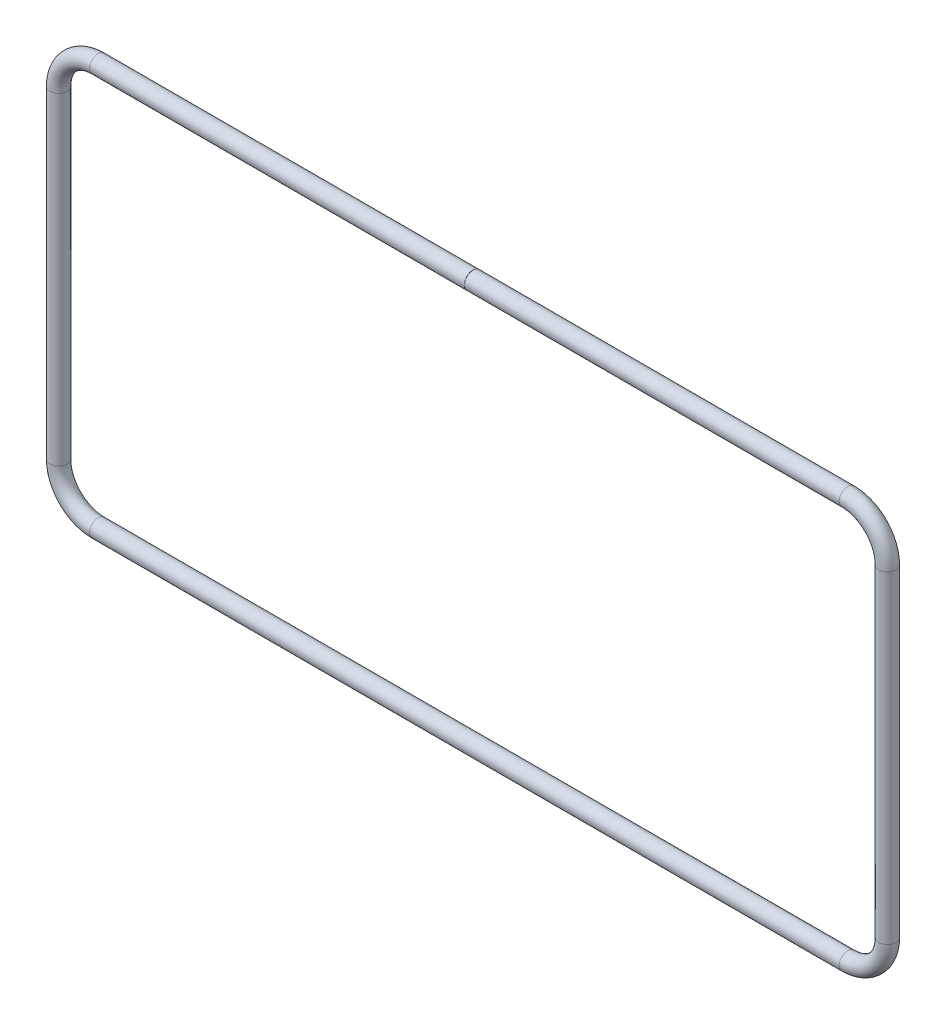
ISO-10303-21;
HEADER;
FILE_DESCRIPTION(('STEP AP214'),'2;1');
FILE_NAME('part.step','',(''),(''),'','','');
FILE_SCHEMA(('AUTOMOTIVE_DESIGN { 1 0 10303 214 1 1 1 1 }'));
ENDSEC;
DATA;
#1=APPLICATION_CONTEXT('core data for automotive mechanical design processes');
#2=APPLICATION_PROTOCOL_DEFINITION('international standard','automotive_design',2000,#1);
#3=PRODUCT_CONTEXT('',#1,'mechanical');
#4=PRODUCT('Part','Part','',(#3));
#5=PRODUCT_RELATED_PRODUCT_CATEGORY('part','',(#4));
#6=PRODUCT_DEFINITION_FORMATION('','',#4);
#7=PRODUCT_DEFINITION_CONTEXT('part definition',#1,'design');
#8=PRODUCT_DEFINITION('design','',#6,#7);
#9=PRODUCT_DEFINITION_SHAPE('','',#8);
#10=(LENGTH_UNIT() NAMED_UNIT(*) SI_UNIT(.MILLI.,.METRE.));
#11=(NAMED_UNIT(*) PLANE_ANGLE_UNIT() SI_UNIT($,.RADIAN.));
#12=(NAMED_UNIT(*) SI_UNIT($,.STERADIAN.) SOLID_ANGLE_UNIT());
#13=UNCERTAINTY_MEASURE_WITH_UNIT(LENGTH_MEASURE(1.E-05),#10,'distance_accuracy_value','');
#14=(GEOMETRIC_REPRESENTATION_CONTEXT(3) GLOBAL_UNCERTAINTY_ASSIGNED_CONTEXT((#13)) GLOBAL_UNIT_ASSIGNED_CONTEXT((#10,
#11,#12)) REPRESENTATION_CONTEXT('',''));
#15=CARTESIAN_POINT('',(0.,0.,0.));
#16=DIRECTION('',(0.,0.,1.));
#17=DIRECTION('',(1.,0.,0.));
#18=AXIS2_PLACEMENT_3D('',#15,#16,#17);
#19=CARTESIAN_POINT('',(76.9492999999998,41.2623000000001,0.));
#20=DIRECTION('',(-0.999999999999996,0.,0.));
#21=DIRECTION('',(0.,-1.,0.));
#22=AXIS2_PLACEMENT_3D('',#19,#20,#21);
#23=CYLINDRICAL_SURFACE('',#22,1.7653);
#24=CARTESIAN_POINT('',(76.9492999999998,41.2623000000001,0.));
#25=DIRECTION('',(0.999999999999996,0.,0.));
#26=DIRECTION('',(0.,0.,-1.));
#27=AXIS2_PLACEMENT_3D('',#24,#25,#26);
#28=CIRCLE('',#27,1.7653);
#29=CARTESIAN_POINT('',(76.9492999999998,43.0276000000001,0.));
#30=VERTEX_POINT('',#29);
#31=EDGE_CURVE('E38',#30,#30,#28,.T.);
#32=ORIENTED_EDGE('',*,*,#31,.F.);
#33=EDGE_LOOP('',(#32));
#34=FACE_BOUND('',#33,.T.);
#35=CARTESIAN_POINT('',(0.0253999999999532,41.2623,0.));
#36=DIRECTION('',(0.999999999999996,0.,0.));
#37=DIRECTION('',(0.,0.,-1.));
#38=AXIS2_PLACEMENT_3D('',#35,#36,#37);
#39=CIRCLE('',#38,1.7653);
#40=CARTESIAN_POINT('',(0.0253999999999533,41.2623,-1.7653));
#41=VERTEX_POINT('',#40);
#42=EDGE_CURVE('E10',#41,#41,#39,.T.);
#43=ORIENTED_EDGE('',*,*,#42,.T.);
#44=EDGE_LOOP('',(#43));
#45=FACE_BOUND('',#44,.T.);
#46=ADVANCED_FACE('F32',(#34,#45),#23,.T.);
#47=CARTESIAN_POINT('',(76.9492999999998,33.1343000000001,0.));
#48=DIRECTION('',(0.,0.,1.));
#49=DIRECTION('',(0.999999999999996,0.,0.));
#50=AXIS2_PLACEMENT_3D('',#47,#48,#49);
#51=TOROIDAL_SURFACE('',#50,8.128,1.7653);
#52=CARTESIAN_POINT('',(85.0772999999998,33.1343000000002,0.));
#53=DIRECTION('',(0.,-1.,0.));
#54=DIRECTION('',(0.,0.,-1.));
#55=AXIS2_PLACEMENT_3D('',#52,#53,#54);
#56=CIRCLE('',#55,1.7653);
#57=CARTESIAN_POINT('',(86.8425999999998,33.1343000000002,0.));
#58=VERTEX_POINT('',#57);
#59=EDGE_CURVE('E42',#58,#58,#56,.T.);
#60=CARTESIAN_POINT('',(76.9492999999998,33.1343000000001,0.));
#61=DIRECTION('',(0.,0.,1.));
#62=DIRECTION('',(0.999999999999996,0.,0.));
#63=AXIS2_PLACEMENT_3D('',#60,#61,#62);
#64=CIRCLE('',#63,9.8933);
#65=EDGE_CURVE('',#58,#30,#64,.T.);
#66=ORIENTED_EDGE('',*,*,#59,.F.);
#67=ORIENTED_EDGE('',*,*,#31,.T.);
#68=ORIENTED_EDGE('',*,*,#65,.T.);
#69=ORIENTED_EDGE('',*,*,#65,.F.);
#70=EDGE_LOOP('',(#66,#68,#67,#69));
#71=FACE_BOUND('',#70,.T.);
#72=ADVANCED_FACE('F88',(#71),#51,.T.);
#73=CARTESIAN_POINT('',(85.0772999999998,-33.1342999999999,0.));
#74=DIRECTION('',(0.,1.,0.));
#75=DIRECTION('',(0.,0.,1.));
#76=AXIS2_PLACEMENT_3D('',#73,#74,#75);
#77=CYLINDRICAL_SURFACE('',#76,1.7653);
#78=CARTESIAN_POINT('',(85.0772999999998,-33.1342999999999,0.));
#79=DIRECTION('',(0.,-1.,0.));
#80=DIRECTION('',(0.,0.,-1.));
#81=AXIS2_PLACEMENT_3D('',#78,#79,#80);
#82=CIRCLE('',#81,1.7653);
#83=CARTESIAN_POINT('',(86.8425999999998,-33.1342999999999,0.));
#84=VERTEX_POINT('',#83);
#85=EDGE_CURVE('E46',#84,#84,#82,.T.);
#86=ORIENTED_EDGE('',*,*,#85,.F.);
#87=EDGE_LOOP('',(#86));
#88=FACE_BOUND('',#87,.T.);
#89=ORIENTED_EDGE('',*,*,#59,.T.);
#90=EDGE_LOOP('',(#89));
#91=FACE_BOUND('',#90,.T.);
#92=ADVANCED_FACE('F93',(#88,#91),#77,.T.);
#93=CARTESIAN_POINT('',(76.9492999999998,-33.1342999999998,0.));
#94=DIRECTION('',(0.,0.,1.));
#95=DIRECTION('',(0.999999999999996,0.,0.));
#96=AXIS2_PLACEMENT_3D('',#93,#94,#95);
#97=TOROIDAL_SURFACE('',#96,8.12799999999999,1.7653);
#98=CARTESIAN_POINT('',(76.9492999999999,-41.2622999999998,0.));
#99=DIRECTION('',(-0.999999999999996,0.,0.));
#100=DIRECTION('',(0.,0.,-1.));
#101=AXIS2_PLACEMENT_3D('',#98,#99,#100);
#102=CIRCLE('',#101,1.7653);
#103=CARTESIAN_POINT('',(76.9492999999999,-43.0275999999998,0.));
#104=VERTEX_POINT('',#103);
#105=EDGE_CURVE('E51',#104,#104,#102,.T.);
#106=CARTESIAN_POINT('',(76.9492999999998,-33.1342999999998,0.));
#107=DIRECTION('',(0.,0.,1.));
#108=DIRECTION('',(0.999999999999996,0.,0.));
#109=AXIS2_PLACEMENT_3D('',#106,#107,#108);
#110=CIRCLE('',#109,9.89329999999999);
#111=EDGE_CURVE('',#104,#84,#110,.T.);
#112=ORIENTED_EDGE('',*,*,#105,.F.);
#113=ORIENTED_EDGE('',*,*,#85,.T.);
#114=ORIENTED_EDGE('',*,*,#111,.T.);
#115=ORIENTED_EDGE('',*,*,#111,.F.);
#116=EDGE_LOOP('',(#112,#114,#113,#115));
#117=FACE_BOUND('',#116,.T.);
#118=ADVANCED_FACE('F98',(#117),#97,.T.);
#119=CARTESIAN_POINT('',(-76.9492999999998,-41.2623000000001,0.));
#120=DIRECTION('',(0.999999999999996,0.,0.));
#121=DIRECTION('',(0.,1.,0.));
#122=AXIS2_PLACEMENT_3D('',#119,#120,#121);
#123=CYLINDRICAL_SURFACE('',#122,1.7653);
#124=CARTESIAN_POINT('',(-76.9492999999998,-41.2623000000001,0.));
#125=DIRECTION('',(-0.999999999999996,0.,0.));
#126=DIRECTION('',(0.,0.,-1.));
#127=AXIS2_PLACEMENT_3D('',#124,#125,#126);
#128=CIRCLE('',#127,1.7653);
#129=CARTESIAN_POINT('',(-76.9492999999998,-43.0276000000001,0.));
#130=VERTEX_POINT('',#129);
#131=EDGE_CURVE('E54',#130,#130,#128,.T.);
#132=ORIENTED_EDGE('',*,*,#131,.F.);
#133=EDGE_LOOP('',(#132));
#134=FACE_BOUND('',#133,.T.);
#135=ORIENTED_EDGE('',*,*,#105,.T.);
#136=EDGE_LOOP('',(#135));
#137=FACE_BOUND('',#136,.T.);
#138=ADVANCED_FACE('F105',(#134,#137),#123,.T.);
#139=CARTESIAN_POINT('',(-76.9492999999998,-33.1343000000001,0.));
#140=DIRECTION('',(0.,0.,1.));
#141=DIRECTION('',(0.999999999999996,0.,0.));
#142=AXIS2_PLACEMENT_3D('',#139,#140,#141);
#143=TOROIDAL_SURFACE('',#142,8.12800000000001,1.7653);
#144=CARTESIAN_POINT('',(-85.0772999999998,-33.1343000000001,0.));
#145=DIRECTION('',(0.,1.,0.));
#146=DIRECTION('',(0.,0.,-1.));
#147=AXIS2_PLACEMENT_3D('',#144,#145,#146);
#148=CIRCLE('',#147,1.7653);
#149=CARTESIAN_POINT('',(-86.8425999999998,-33.1343000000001,0.));
#150=VERTEX_POINT('',#149);
#151=EDGE_CURVE('E57',#150,#150,#148,.T.);
#152=CARTESIAN_POINT('',(-76.9492999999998,-33.1343000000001,0.));
#153=DIRECTION('',(0.,0.,1.));
#154=DIRECTION('',(0.999999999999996,0.,0.));
#155=AXIS2_PLACEMENT_3D('',#152,#153,#154);
#156=CIRCLE('',#155,9.89330000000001);
#157=EDGE_CURVE('',#150,#130,#156,.T.);
#158=ORIENTED_EDGE('',*,*,#151,.F.);
#159=ORIENTED_EDGE('',*,*,#131,.T.);
#160=ORIENTED_EDGE('',*,*,#157,.T.);
#161=ORIENTED_EDGE('',*,*,#157,.F.);
#162=EDGE_LOOP('',(#158,#160,#159,#161));
#163=FACE_BOUND('',#162,.T.);
#164=ADVANCED_FACE('F109',(#163),#143,.T.);
#165=CARTESIAN_POINT('',(-85.0772999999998,33.1342999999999,0.));
#166=DIRECTION('',(0.,-1.,0.));
#167=DIRECTION('',(0.,0.,-1.));
#168=AXIS2_PLACEMENT_3D('',#165,#166,#167);
#169=CYLINDRICAL_SURFACE('',#168,1.7653);
#170=CARTESIAN_POINT('',(-85.0772999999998,33.1342999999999,0.));
#171=DIRECTION('',(0.,1.,0.));
#172=DIRECTION('',(0.,0.,-1.));
#173=AXIS2_PLACEMENT_3D('',#170,#171,#172);
#174=CIRCLE('',#173,1.7653);
#175=CARTESIAN_POINT('',(-86.8425999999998,33.1342999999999,0.));
#176=VERTEX_POINT('',#175);
#177=EDGE_CURVE('E60',#176,#176,#174,.T.);
#178=ORIENTED_EDGE('',*,*,#177,.F.);
#179=EDGE_LOOP('',(#178));
#180=FACE_BOUND('',#179,.T.);
#181=ORIENTED_EDGE('',*,*,#151,.T.);
#182=EDGE_LOOP('',(#181));
#183=FACE_BOUND('',#182,.T.);
#184=ADVANCED_FACE('F84',(#180,#183),#169,.T.);
#185=CARTESIAN_POINT('',(-76.9492999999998,33.1342999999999,0.));
#186=DIRECTION('',(0.,0.,1.));
#187=DIRECTION('',(0.999999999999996,0.,0.));
#188=AXIS2_PLACEMENT_3D('',#185,#186,#187);
#189=TOROIDAL_SURFACE('',#188,8.128,1.7653);
#190=CARTESIAN_POINT('',(-76.9492999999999,41.2622999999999,0.));
#191=DIRECTION('',(0.999999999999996,0.,0.));
#192=DIRECTION('',(0.,0.,-1.));
#193=AXIS2_PLACEMENT_3D('',#190,#191,#192);
#194=CIRCLE('',#193,1.7653);
#195=CARTESIAN_POINT('',(-76.9492999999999,43.0275999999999,0.));
#196=VERTEX_POINT('',#195);
#197=EDGE_CURVE('E63',#196,#196,#194,.T.);
#198=CARTESIAN_POINT('',(-76.9492999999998,33.1342999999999,0.));
#199=DIRECTION('',(0.,0.,1.));
#200=DIRECTION('',(0.999999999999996,0.,0.));
#201=AXIS2_PLACEMENT_3D('',#198,#199,#200);
#202=CIRCLE('',#201,9.8933);
#203=EDGE_CURVE('',#196,#176,#202,.T.);
#204=ORIENTED_EDGE('',*,*,#197,.F.);
#205=ORIENTED_EDGE('',*,*,#177,.T.);
#206=ORIENTED_EDGE('',*,*,#203,.T.);
#207=ORIENTED_EDGE('',*,*,#203,.F.);
#208=EDGE_LOOP('',(#204,#206,#205,#207));
#209=FACE_BOUND('',#208,.T.);
#210=ADVANCED_FACE('F75',(#209),#189,.T.);
#211=CARTESIAN_POINT('',(-76.9492999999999,41.2622999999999,0.));
#212=DIRECTION('',(0.999999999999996,0.,0.));
#213=DIRECTION('',(0.,1.,0.));
#214=AXIS2_PLACEMENT_3D('',#211,#212,#213);
#215=CYLINDRICAL_SURFACE('',#214,1.7653);
#216=CARTESIAN_POINT('',(0.,41.2623,0.));
#217=DIRECTION('',(0.999999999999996,0.,0.));
#218=DIRECTION('',(0.,0.,-1.));
#219=AXIS2_PLACEMENT_3D('',#216,#217,#218);
#220=CIRCLE('',#219,1.7653);
#221=CARTESIAN_POINT('',(0.,43.0276,0.));
#222=VERTEX_POINT('',#221);
#223=EDGE_CURVE('E66',#222,#222,#220,.T.);
#224=CARTESIAN_POINT('',(-76.9492999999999,43.0275999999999,0.));
#225=CARTESIAN_POINT('',(-76.1477447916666,43.0275999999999,0.));
#226=CARTESIAN_POINT('',(-75.3461895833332,43.0275999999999,0.));
#227=CARTESIAN_POINT('',(-73.7430791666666,43.0275999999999,0.));
#228=CARTESIAN_POINT('',(-72.9415239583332,43.0275999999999,0.));
#229=CARTESIAN_POINT('',(-71.3384135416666,43.0275999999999,0.));
#230=CARTESIAN_POINT('',(-70.5368583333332,43.0275999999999,0.));
#231=CARTESIAN_POINT('',(-68.9337479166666,43.0275999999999,0.));
#232=CARTESIAN_POINT('',(-68.1321927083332,43.0275999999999,0.));
#233=CARTESIAN_POINT('',(-66.5290822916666,43.0275999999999,0.));
#234=CARTESIAN_POINT('',(-65.7275270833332,43.0275999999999,0.));
#235=CARTESIAN_POINT('',(-64.1244166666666,43.0275999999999,0.));
#236=CARTESIAN_POINT('',(-63.3228614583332,43.0275999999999,0.));
#237=CARTESIAN_POINT('',(-61.7197510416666,43.0275999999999,0.));
#238=CARTESIAN_POINT('',(-60.9181958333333,43.0275999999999,0.));
#239=CARTESIAN_POINT('',(-59.3150854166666,43.0275999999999,0.));
#240=CARTESIAN_POINT('',(-58.5135302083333,43.0275999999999,0.));
#241=CARTESIAN_POINT('',(-56.9104197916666,43.0275999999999,0.));
#242=CARTESIAN_POINT('',(-56.1088645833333,43.0275999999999,0.));
#243=CARTESIAN_POINT('',(-54.5057541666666,43.0275999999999,0.));
#244=CARTESIAN_POINT('',(-53.7041989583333,43.0275999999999,0.));
#245=CARTESIAN_POINT('',(-52.1010885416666,43.0275999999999,0.));
#246=CARTESIAN_POINT('',(-51.2995333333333,43.0275999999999,0.));
#247=CARTESIAN_POINT('',(-49.6964229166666,43.0275999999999,0.));
#248=CARTESIAN_POINT('',(-48.8948677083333,43.0275999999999,0.));
#249=CARTESIAN_POINT('',(-47.2917572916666,43.0275999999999,0.));
#250=CARTESIAN_POINT('',(-46.4902020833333,43.0275999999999,0.));
#251=CARTESIAN_POINT('',(-44.8870916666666,43.0275999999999,0.));
#252=CARTESIAN_POINT('',(-44.0855364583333,43.0275999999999,0.));
#253=CARTESIAN_POINT('',(-42.4824260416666,43.0275999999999,0.));
#254=CARTESIAN_POINT('',(-41.6808708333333,43.0275999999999,0.));
#255=CARTESIAN_POINT('',(-40.0777604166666,43.0275999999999,0.));
#256=CARTESIAN_POINT('',(-39.2762052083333,43.0275999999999,0.));
#257=CARTESIAN_POINT('',(-37.6730947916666,43.0275999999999,0.));
#258=CARTESIAN_POINT('',(-36.8715395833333,43.0275999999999,0.));
#259=CARTESIAN_POINT('',(-35.2684291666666,43.0275999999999,0.));
#260=CARTESIAN_POINT('',(-34.4668739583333,43.0275999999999,0.));
#261=CARTESIAN_POINT('',(-32.8637635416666,43.0275999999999,0.));
#262=CARTESIAN_POINT('',(-32.0622083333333,43.0275999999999,0.));
#263=CARTESIAN_POINT('',(-30.4590979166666,43.0275999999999,0.));
#264=CARTESIAN_POINT('',(-29.6575427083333,43.0275999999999,0.));
#265=CARTESIAN_POINT('',(-28.0544322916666,43.0275999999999,0.));
#266=CARTESIAN_POINT('',(-27.2528770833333,43.0276,0.));
#267=CARTESIAN_POINT('',(-25.6497666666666,43.0276,0.));
#268=CARTESIAN_POINT('',(-24.8482114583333,43.0276,0.));
#269=CARTESIAN_POINT('',(-23.2451010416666,43.0276,0.));
#270=CARTESIAN_POINT('',(-22.4435458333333,43.0276,0.));
#271=CARTESIAN_POINT('',(-20.8404354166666,43.0276,0.));
#272=CARTESIAN_POINT('',(-20.0388802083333,43.0276,0.));
#273=CARTESIAN_POINT('',(-18.4357697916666,43.0276,0.));
#274=CARTESIAN_POINT('',(-17.6342145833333,43.0276,0.));
#275=CARTESIAN_POINT('',(-16.0311041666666,43.0276,0.));
#276=CARTESIAN_POINT('',(-15.2295489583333,43.0276,0.));
#277=CARTESIAN_POINT('',(-13.6264385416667,43.0276,0.));
#278=CARTESIAN_POINT('',(-12.8248833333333,43.0276,0.));
#279=CARTESIAN_POINT('',(-11.2217729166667,43.0276,0.));
#280=CARTESIAN_POINT('',(-10.4202177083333,43.0276,0.));
#281=CARTESIAN_POINT('',(-8.81710729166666,43.0276,0.));
#282=CARTESIAN_POINT('',(-8.01555208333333,43.0276,0.));
#283=CARTESIAN_POINT('',(-6.41244166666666,43.0276,0.));
#284=CARTESIAN_POINT('',(-5.61088645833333,43.0276,0.));
#285=CARTESIAN_POINT('',(-4.00777604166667,43.0276,0.));
#286=CARTESIAN_POINT('',(-3.20622083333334,43.0276,0.));
#287=CARTESIAN_POINT('',(-1.60311041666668,43.0276,0.));
#288=CARTESIAN_POINT('',(-0.801555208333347,43.0276,0.));
#289=CARTESIAN_POINT('',(0.,43.0276,0.));
#290=B_SPLINE_CURVE_WITH_KNOTS('',3,(#224,#225,#226,#227,#228,#229,#230,#231,#232,#233,#234,
#235,#236,#237,#238,#239,#240,#241,#242,#243,#244,#245,#246,#247,#248,#249,#250,#251,#252,#253,
#254,#255,#256,#257,#258,#259,#260,#261,#262,#263,#264,#265,#266,#267,#268,#269,#270,#271,#272,
#273,#274,#275,#276,#277,#278,#279,#280,#281,#282,#283,#284,#285,#286,#287,#288,#289),
.UNSPECIFIED.,.F.,.F.,(4,2,2,2,2,2,2,2,2,2,2,2,2,2,2,2,2,2,2,2,2,2,2,2,2,2,2,2,2,2,2,2,4),(0.,
2.40466562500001,4.80933125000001,7.213996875,9.6186625,12.023328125,14.42799375,16.832659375,
19.237325,21.641990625,24.04665625,26.451321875,28.8559875,31.260653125,33.66531875,
36.069984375,38.4746499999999,40.879315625,43.2839812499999,45.6886468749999,48.0933124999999,
50.4979781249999,52.9026437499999,55.3073093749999,57.7119749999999,60.1166406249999,
62.5213062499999,64.9259718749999,67.3306374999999,69.7353031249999,72.1399687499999,
74.5446343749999,76.9492999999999),.UNSPECIFIED.);
#291=EDGE_CURVE('BSEAM72',#196,#222,#290,.T.);
#292=ORIENTED_EDGE('',*,*,#197,.T.);
#293=ORIENTED_EDGE('',*,*,#223,.F.);
#294=ORIENTED_EDGE('',*,*,#291,.T.);
#295=ORIENTED_EDGE('',*,*,#291,.F.);
#296=EDGE_LOOP('',(#292,#294,#293,#295));
#297=FACE_BOUND('',#296,.T.);
#298=ADVANCED_FACE('F72',(#297),#215,.T.);
#299=CARTESIAN_POINT('',(0.0253999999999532,41.2623,0.));
#300=DIRECTION('',(0.999999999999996,0.,0.));
#301=DIRECTION('',(0.,0.,-1.));
#302=AXIS2_PLACEMENT_3D('',#299,#300,#301);
#303=PLANE('',#302);
#304=ORIENTED_EDGE('',*,*,#42,.F.);
#305=EDGE_LOOP('',(#304));
#306=FACE_BOUND('',#305,.T.);
#307=ADVANCED_FACE('F74',(#306),#303,.F.);
#308=CARTESIAN_POINT('',(0.,41.2623,0.));
#309=DIRECTION('',(0.999999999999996,0.,0.));
#310=DIRECTION('',(0.,0.,-1.));
#311=AXIS2_PLACEMENT_3D('',#308,#309,#310);
#312=PLANE('',#311);
#313=ORIENTED_EDGE('',*,*,#223,.T.);
#314=EDGE_LOOP('',(#313));
#315=FACE_BOUND('',#314,.T.);
#316=ADVANCED_FACE('F70',(#315),#312,.T.);
#317=CLOSED_SHELL('',(#46,#72,#92,#118,#138,#164,#184,#210,#298,#307,#316));
#318=MANIFOLD_SOLID_BREP('B2',#317);
#319=ADVANCED_BREP_SHAPE_REPRESENTATION('',(#18,#318),#14);
#320=SHAPE_DEFINITION_REPRESENTATION(#9,#319);
ENDSEC;
END-ISO-10303-21;
